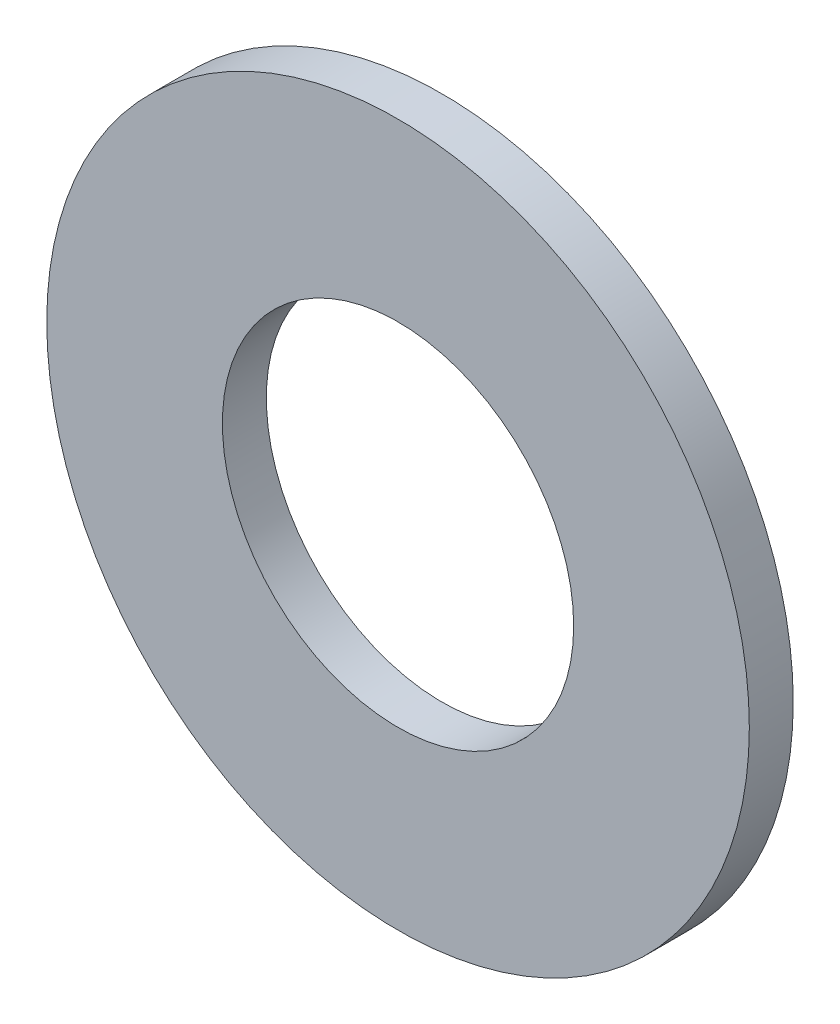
from build123d import *

# Parameters (mm, degrees)
SKETCH_1_R        = 8
SKETCH_1_R_2      = 4
EXTRUDE_251_DEPTH = 1


with BuildPart() as part:
    # Sketch 1 → Extrude 251 (new body)
    with BuildSketch(Plane.XY):
        with Locations((-10, -20)):
            Circle(SKETCH_1_R)
        with Locations((-10, -20)):
            Circle(SKETCH_1_R_2, mode=Mode.SUBTRACT)
    extrude(amount=EXTRUDE_251_DEPTH)


solid = part.part
